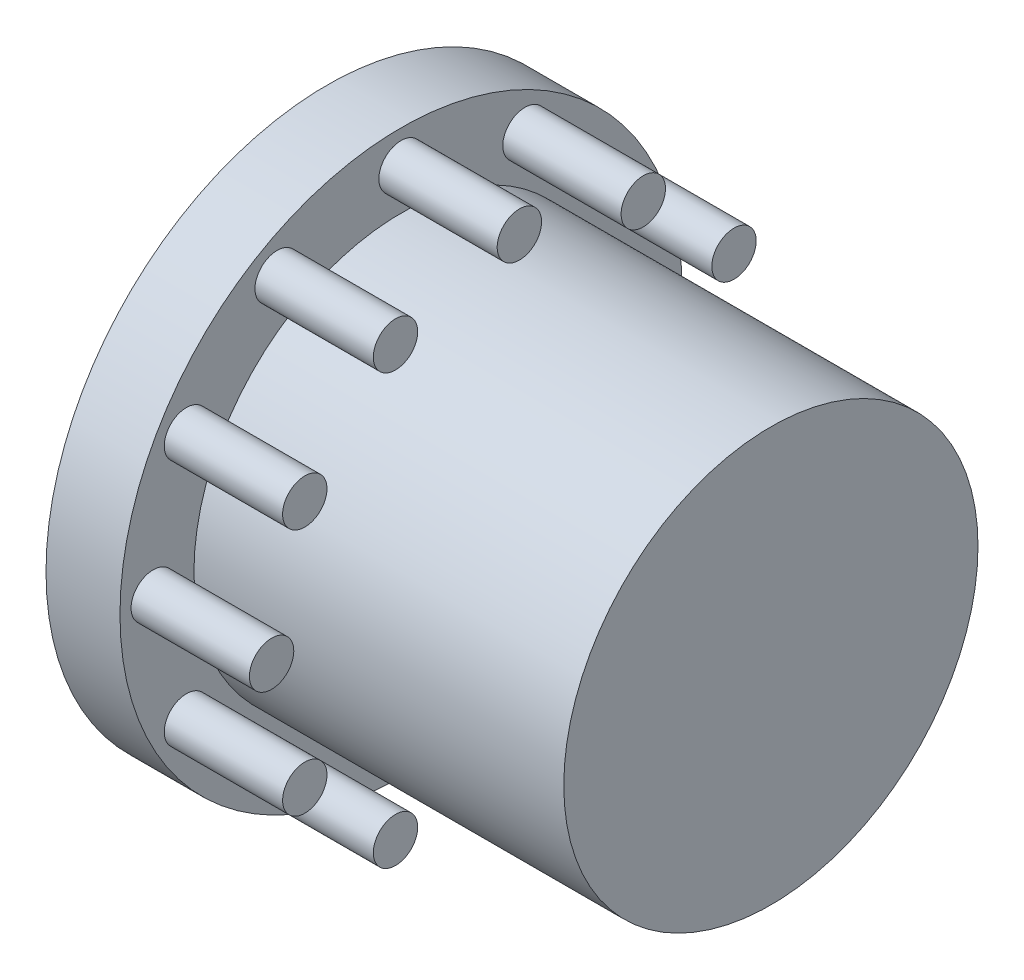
ISO-10303-21;
HEADER;
FILE_DESCRIPTION(('STEP AP214'),'2;1');
FILE_NAME('part.step','',(''),(''),'','','');
FILE_SCHEMA(('AUTOMOTIVE_DESIGN { 1 0 10303 214 1 1 1 1 }'));
ENDSEC;
DATA;
#1=APPLICATION_CONTEXT('core data for automotive mechanical design processes');
#2=APPLICATION_PROTOCOL_DEFINITION('international standard','automotive_design',2000,#1);
#3=PRODUCT_CONTEXT('',#1,'mechanical');
#4=PRODUCT('Part','Part','',(#3));
#5=PRODUCT_RELATED_PRODUCT_CATEGORY('part','',(#4));
#6=PRODUCT_DEFINITION_FORMATION('','',#4);
#7=PRODUCT_DEFINITION_CONTEXT('part definition',#1,'design');
#8=PRODUCT_DEFINITION('design','',#6,#7);
#9=PRODUCT_DEFINITION_SHAPE('','',#8);
#10=(LENGTH_UNIT() NAMED_UNIT(*) SI_UNIT(.MILLI.,.METRE.));
#11=(NAMED_UNIT(*) PLANE_ANGLE_UNIT() SI_UNIT($,.RADIAN.));
#12=(NAMED_UNIT(*) SI_UNIT($,.STERADIAN.) SOLID_ANGLE_UNIT());
#13=UNCERTAINTY_MEASURE_WITH_UNIT(LENGTH_MEASURE(1.E-05),#10,'distance_accuracy_value','');
#14=(GEOMETRIC_REPRESENTATION_CONTEXT(3) GLOBAL_UNCERTAINTY_ASSIGNED_CONTEXT((#13)) GLOBAL_UNIT_ASSIGNED_CONTEXT((#10,
#11,#12)) REPRESENTATION_CONTEXT('',''));
#15=CARTESIAN_POINT('',(0.,0.,0.));
#16=DIRECTION('',(0.,0.,1.));
#17=DIRECTION('',(1.,0.,0.));
#18=AXIS2_PLACEMENT_3D('',#15,#16,#17);
#19=CARTESIAN_POINT('',(130.,167.5,0.));
#20=DIRECTION('',(-1.,0.,0.));
#21=DIRECTION('',(0.,0.,1.));
#22=AXIS2_PLACEMENT_3D('',#19,#20,#21);
#23=CYLINDRICAL_SURFACE('',#22,15.);
#24=CARTESIAN_POINT('',(130.,167.5,0.));
#25=DIRECTION('',(1.,0.,0.));
#26=DIRECTION('',(0.,0.,-1.));
#27=AXIS2_PLACEMENT_3D('',#24,#25,#26);
#28=CIRCLE('',#27,15.);
#29=CARTESIAN_POINT('',(130.,167.5,-15.));
#30=VERTEX_POINT('',#29);
#31=EDGE_CURVE('E11',#30,#30,#28,.T.);
#32=ORIENTED_EDGE('',*,*,#31,.F.);
#33=EDGE_LOOP('',(#32));
#34=FACE_BOUND('',#33,.T.);
#35=CARTESIAN_POINT('',(50.,167.5,0.));
#36=DIRECTION('',(1.,0.,0.));
#37=DIRECTION('',(0.,0.,-1.));
#38=AXIS2_PLACEMENT_3D('',#35,#36,#37);
#39=CIRCLE('',#38,15.);
#40=CARTESIAN_POINT('',(50.,167.5,-15.));
#41=VERTEX_POINT('',#40);
#42=EDGE_CURVE('E47',#41,#41,#39,.T.);
#43=ORIENTED_EDGE('',*,*,#42,.T.);
#44=EDGE_LOOP('',(#43));
#45=FACE_BOUND('',#44,.T.);
#46=ADVANCED_FACE('F44',(#34,#45),#23,.T.);
#47=CARTESIAN_POINT('',(130.,167.5,0.));
#48=DIRECTION('',(1.,0.,0.));
#49=DIRECTION('',(0.,0.,-1.));
#50=AXIS2_PLACEMENT_3D('',#47,#48,#49);
#51=PLANE('',#50);
#52=ORIENTED_EDGE('',*,*,#31,.T.);
#53=EDGE_LOOP('',(#52));
#54=FACE_BOUND('',#53,.T.);
#55=ADVANCED_FACE('F59',(#54),#51,.T.);
#56=CARTESIAN_POINT('',(50.,167.5,0.));
#57=DIRECTION('',(1.,0.,0.));
#58=DIRECTION('',(0.,0.,-1.));
#59=AXIS2_PLACEMENT_3D('',#56,#57,#58);
#60=PLANE('',#59);
#61=ORIENTED_EDGE('',*,*,#42,.F.);
#62=EDGE_LOOP('',(#61));
#63=FACE_BOUND('',#62,.T.);
#64=ADVANCED_FACE('F57',(#63),#60,.F.);
#65=CLOSED_SHELL('',(#46,#55,#64));
#66=MANIFOLD_SOLID_BREP('B2',#65);
#67=CARTESIAN_POINT('',(50.,0.,0.));
#68=DIRECTION('',(-1.,0.,0.));
#69=DIRECTION('',(0.,0.,1.));
#70=AXIS2_PLACEMENT_3D('',#67,#68,#69);
#71=CYLINDRICAL_SURFACE('',#70,190.);
#72=CARTESIAN_POINT('',(50.,0.,0.));
#73=DIRECTION('',(1.,0.,0.));
#74=DIRECTION('',(0.,0.,-1.));
#75=AXIS2_PLACEMENT_3D('',#72,#73,#74);
#76=CIRCLE('',#75,190.);
#77=CARTESIAN_POINT('',(50.,0.,-190.));
#78=VERTEX_POINT('',#77);
#79=EDGE_CURVE('E43',#78,#78,#76,.T.);
#80=ORIENTED_EDGE('',*,*,#79,.F.);
#81=EDGE_LOOP('',(#80));
#82=FACE_BOUND('',#81,.T.);
#83=CARTESIAN_POINT('',(0.,0.,0.));
#84=DIRECTION('',(1.,0.,0.));
#85=DIRECTION('',(0.,0.,-1.));
#86=AXIS2_PLACEMENT_3D('',#83,#84,#85);
#87=CIRCLE('',#86,190.);
#88=CARTESIAN_POINT('',(0.,0.,-190.));
#89=VERTEX_POINT('',#88);
#90=EDGE_CURVE('E93',#89,#89,#87,.T.);
#91=ORIENTED_EDGE('',*,*,#90,.T.);
#92=EDGE_LOOP('',(#91));
#93=FACE_BOUND('',#92,.T.);
#94=ADVANCED_FACE('F90',(#82,#93),#71,.T.);
#95=CARTESIAN_POINT('',(50.,0.,0.));
#96=DIRECTION('',(1.,0.,0.));
#97=DIRECTION('',(0.,0.,-1.));
#98=AXIS2_PLACEMENT_3D('',#95,#96,#97);
#99=PLANE('',#98);
#100=CARTESIAN_POINT('',(50.,145.059255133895,-83.7499999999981));
#101=DIRECTION('',(1.,0.,0.));
#102=DIRECTION('',(0.,-0.499999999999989,-0.866025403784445));
#103=AXIS2_PLACEMENT_3D('',#100,#101,#102);
#104=CIRCLE('',#103,15.);
#105=CARTESIAN_POINT('',(50.,137.559255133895,-96.7403810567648));
#106=VERTEX_POINT('',#105);
#107=EDGE_CURVE('E173',#106,#106,#104,.T.);
#108=ORIENTED_EDGE('',*,*,#107,.F.);
#109=EDGE_LOOP('',(#108));
#110=FACE_BOUND('',#109,.T.);
#111=CARTESIAN_POINT('',(50.,83.7500000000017,-145.059255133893));
#112=DIRECTION('',(1.,0.,0.));
#113=DIRECTION('',(0.,-0.866025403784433,-0.50000000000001));
#114=AXIS2_PLACEMENT_3D('',#111,#112,#113);
#115=CIRCLE('',#114,15.);
#116=CARTESIAN_POINT('',(50.,70.7596189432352,-152.559255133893));
#117=VERTEX_POINT('',#116);
#118=EDGE_CURVE('E167',#117,#117,#115,.T.);
#119=ORIENTED_EDGE('',*,*,#118,.F.);
#120=EDGE_LOOP('',(#119));
#121=FACE_BOUND('',#120,.T.);
#122=CARTESIAN_POINT('',(50.,1.75446937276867E-12,-167.5));
#123=DIRECTION('',(1.,0.,0.));
#124=DIRECTION('',(0.,-1.,0.));
#125=AXIS2_PLACEMENT_3D('',#122,#123,#124);
#126=CIRCLE('',#125,15.);
#127=CARTESIAN_POINT('',(50.,-14.9999999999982,-167.5));
#128=VERTEX_POINT('',#127);
#129=EDGE_CURVE('E161',#128,#128,#126,.T.);
#130=ORIENTED_EDGE('',*,*,#129,.F.);
#131=EDGE_LOOP('',(#130));
#132=FACE_BOUND('',#131,.T.);
#133=CARTESIAN_POINT('',(50.,-83.7499999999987,-145.059255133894));
#134=DIRECTION('',(1.,0.,0.));
#135=DIRECTION('',(0.,-0.866025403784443,0.499999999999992));
#136=AXIS2_PLACEMENT_3D('',#133,#134,#135);
#137=CIRCLE('',#136,15.);
#138=CARTESIAN_POINT('',(50.,-96.7403810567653,-137.559255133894));
#139=VERTEX_POINT('',#138);
#140=EDGE_CURVE('E155',#139,#139,#137,.T.);
#141=ORIENTED_EDGE('',*,*,#140,.F.);
#142=EDGE_LOOP('',(#141));
#143=FACE_BOUND('',#142,.T.);
#144=CARTESIAN_POINT('',(50.,-145.059255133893,-83.7500000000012));
#145=DIRECTION('',(1.,0.,0.));
#146=DIRECTION('',(0.,-0.500000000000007,0.866025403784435));
#147=AXIS2_PLACEMENT_3D('',#144,#145,#146);
#148=CIRCLE('',#147,15.);
#149=CARTESIAN_POINT('',(50.,-152.559255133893,-70.7596189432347));
#150=VERTEX_POINT('',#149);
#151=EDGE_CURVE('E149',#150,#150,#148,.T.);
#152=ORIENTED_EDGE('',*,*,#151,.F.);
#153=EDGE_LOOP('',(#152));
#154=FACE_BOUND('',#153,.T.);
#155=CARTESIAN_POINT('',(50.,-167.5,0.));
#156=DIRECTION('',(1.,0.,0.));
#157=DIRECTION('',(0.,0.,1.));
#158=AXIS2_PLACEMENT_3D('',#155,#156,#157);
#159=CIRCLE('',#158,15.);
#160=CARTESIAN_POINT('',(50.,-167.5,15.));
#161=VERTEX_POINT('',#160);
#162=EDGE_CURVE('E143',#161,#161,#159,.T.);
#163=ORIENTED_EDGE('',*,*,#162,.F.);
#164=EDGE_LOOP('',(#163));
#165=FACE_BOUND('',#164,.T.);
#166=CARTESIAN_POINT('',(50.,-145.059255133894,83.7499999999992));
#167=DIRECTION('',(1.,0.,0.));
#168=DIRECTION('',(0.,0.499999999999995,0.866025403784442));
#169=AXIS2_PLACEMENT_3D('',#166,#167,#168);
#170=CIRCLE('',#169,15.);
#171=CARTESIAN_POINT('',(50.,-137.559255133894,96.7403810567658));
#172=VERTEX_POINT('',#171);
#173=EDGE_CURVE('E137',#172,#172,#170,.T.);
#174=ORIENTED_EDGE('',*,*,#173,.F.);
#175=EDGE_LOOP('',(#174));
#176=FACE_BOUND('',#175,.T.);
#177=CARTESIAN_POINT('',(50.,-83.7500000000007,145.059255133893));
#178=DIRECTION('',(1.,0.,0.));
#179=DIRECTION('',(0.,0.866025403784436,0.500000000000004));
#180=AXIS2_PLACEMENT_3D('',#177,#178,#179);
#181=CIRCLE('',#180,15.);
#182=CARTESIAN_POINT('',(50.,-70.7596189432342,152.559255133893));
#183=VERTEX_POINT('',#182);
#184=EDGE_CURVE('E131',#183,#183,#181,.T.);
#185=ORIENTED_EDGE('',*,*,#184,.F.);
#186=EDGE_LOOP('',(#185));
#187=FACE_BOUND('',#186,.T.);
#188=CARTESIAN_POINT('',(50.,-5.84823124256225E-13,167.5));
#189=DIRECTION('',(1.,0.,0.));
#190=DIRECTION('',(0.,1.,0.));
#191=AXIS2_PLACEMENT_3D('',#188,#189,#190);
#192=CIRCLE('',#191,15.);
#193=CARTESIAN_POINT('',(50.,14.9999999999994,167.5));
#194=VERTEX_POINT('',#193);
#195=EDGE_CURVE('E125',#194,#194,#192,.T.);
#196=ORIENTED_EDGE('',*,*,#195,.F.);
#197=EDGE_LOOP('',(#196));
#198=FACE_BOUND('',#197,.T.);
#199=CARTESIAN_POINT('',(50.,83.7499999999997,145.059255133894));
#200=DIRECTION('',(1.,0.,0.));
#201=DIRECTION('',(0.,0.86602540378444,-0.499999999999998));
#202=AXIS2_PLACEMENT_3D('',#199,#200,#201);
#203=CIRCLE('',#202,15.);
#204=CARTESIAN_POINT('',(50.,96.7403810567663,137.559255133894));
#205=VERTEX_POINT('',#204);
#206=EDGE_CURVE('E119',#205,#205,#203,.T.);
#207=ORIENTED_EDGE('',*,*,#206,.F.);
#208=EDGE_LOOP('',(#207));
#209=FACE_BOUND('',#208,.T.);
#210=CARTESIAN_POINT('',(50.,145.059255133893,83.7500000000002));
#211=DIRECTION('',(1.,0.,0.));
#212=DIRECTION('',(0.,0.500000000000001,-0.866025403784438));
#213=AXIS2_PLACEMENT_3D('',#210,#211,#212);
#214=CIRCLE('',#213,15.);
#215=CARTESIAN_POINT('',(50.,152.559255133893,70.7596189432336));
#216=VERTEX_POINT('',#215);
#217=EDGE_CURVE('E113',#216,#216,#214,.T.);
#218=ORIENTED_EDGE('',*,*,#217,.F.);
#219=EDGE_LOOP('',(#218));
#220=FACE_BOUND('',#219,.T.);
#221=CARTESIAN_POINT('',(50.,0.,0.));
#222=DIRECTION('',(1.,0.,0.));
#223=DIRECTION('',(0.,0.,-1.));
#224=AXIS2_PLACEMENT_3D('',#221,#222,#223);
#225=CIRCLE('',#224,140.);
#226=CARTESIAN_POINT('',(50.,0.,-140.));
#227=VERTEX_POINT('',#226);
#228=EDGE_CURVE('E105',#227,#227,#225,.F.);
#229=ORIENTED_EDGE('',*,*,#228,.T.);
#230=EDGE_LOOP('',(#229));
#231=FACE_BOUND('',#230,.T.);
#232=ORIENTED_EDGE('',*,*,#79,.T.);
#233=EDGE_LOOP('',(#232));
#234=FACE_BOUND('',#233,.T.);
#235=ADVANCED_FACE('F189',(#110,#121,#132,#143,#154,#165,#176,#187,#198,#209,#220,#231,#234),
#99,.T.);
#236=CARTESIAN_POINT('',(0.,0.,0.));
#237=DIRECTION('',(1.,0.,0.));
#238=DIRECTION('',(0.,0.,-1.));
#239=AXIS2_PLACEMENT_3D('',#236,#237,#238);
#240=PLANE('',#239);
#241=ORIENTED_EDGE('',*,*,#90,.F.);
#242=EDGE_LOOP('',(#241));
#243=FACE_BOUND('',#242,.T.);
#244=CARTESIAN_POINT('',(0.,0.,0.));
#245=DIRECTION('',(1.,0.,0.));
#246=DIRECTION('',(0.,0.,-1.));
#247=AXIS2_PLACEMENT_3D('',#244,#245,#246);
#248=CIRCLE('',#247,50.);
#249=CARTESIAN_POINT('',(0.,0.,-50.));
#250=VERTEX_POINT('',#249);
#251=EDGE_CURVE('E102',#250,#250,#248,.T.);
#252=ORIENTED_EDGE('',*,*,#251,.T.);
#253=EDGE_LOOP('',(#252));
#254=FACE_BOUND('',#253,.T.);
#255=ADVANCED_FACE('F192',(#243,#254),#240,.F.);
#256=CARTESIAN_POINT('',(-50.,0.,0.));
#257=DIRECTION('',(1.,0.,0.));
#258=DIRECTION('',(0.,0.,-1.));
#259=AXIS2_PLACEMENT_3D('',#256,#257,#258);
#260=CYLINDRICAL_SURFACE('',#259,50.);
#261=CARTESIAN_POINT('',(-50.,0.,0.));
#262=DIRECTION('',(1.,0.,0.));
#263=DIRECTION('',(0.,0.,-1.));
#264=AXIS2_PLACEMENT_3D('',#261,#262,#263);
#265=CIRCLE('',#264,50.);
#266=CARTESIAN_POINT('',(-50.,0.,-50.));
#267=VERTEX_POINT('',#266);
#268=EDGE_CURVE('E100',#267,#267,#265,.T.);
#269=ORIENTED_EDGE('',*,*,#268,.T.);
#270=EDGE_LOOP('',(#269));
#271=FACE_BOUND('',#270,.T.);
#272=ORIENTED_EDGE('',*,*,#251,.F.);
#273=EDGE_LOOP('',(#272));
#274=FACE_BOUND('',#273,.T.);
#275=ADVANCED_FACE('F247',(#271,#274),#260,.T.);
#276=CARTESIAN_POINT('',(-50.,0.,0.));
#277=DIRECTION('',(1.,0.,0.));
#278=DIRECTION('',(0.,0.,-1.));
#279=AXIS2_PLACEMENT_3D('',#276,#277,#278);
#280=PLANE('',#279);
#281=ORIENTED_EDGE('',*,*,#268,.F.);
#282=EDGE_LOOP('',(#281));
#283=FACE_BOUND('',#282,.T.);
#284=ADVANCED_FACE('F220',(#283),#280,.F.);
#285=CARTESIAN_POINT('',(300.,0.,0.));
#286=DIRECTION('',(-1.,0.,0.));
#287=DIRECTION('',(0.,0.,1.));
#288=AXIS2_PLACEMENT_3D('',#285,#286,#287);
#289=CYLINDRICAL_SURFACE('',#288,140.);
#290=ORIENTED_EDGE('',*,*,#228,.F.);
#291=EDGE_LOOP('',(#290));
#292=FACE_BOUND('',#291,.T.);
#293=CARTESIAN_POINT('',(300.,0.,0.));
#294=DIRECTION('',(1.,0.,0.));
#295=DIRECTION('',(0.,0.,-1.));
#296=AXIS2_PLACEMENT_3D('',#293,#294,#295);
#297=CIRCLE('',#296,140.);
#298=CARTESIAN_POINT('',(300.,0.,-140.));
#299=VERTEX_POINT('',#298);
#300=EDGE_CURVE('E110',#299,#299,#297,.T.);
#301=ORIENTED_EDGE('',*,*,#300,.F.);
#302=EDGE_LOOP('',(#301));
#303=FACE_BOUND('',#302,.T.);
#304=ADVANCED_FACE('F216',(#292,#303),#289,.T.);
#305=CARTESIAN_POINT('',(300.,0.,0.));
#306=DIRECTION('',(1.,0.,0.));
#307=DIRECTION('',(0.,0.,-1.));
#308=AXIS2_PLACEMENT_3D('',#305,#306,#307);
#309=PLANE('',#308);
#310=ORIENTED_EDGE('',*,*,#300,.T.);
#311=EDGE_LOOP('',(#310));
#312=FACE_BOUND('',#311,.T.);
#313=ADVANCED_FACE('F219',(#312),#309,.T.);
#314=CARTESIAN_POINT('',(130.,145.059255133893,83.7500000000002));
#315=DIRECTION('',(-1.,0.,0.));
#316=DIRECTION('',(0.,-0.500000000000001,0.866025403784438));
#317=AXIS2_PLACEMENT_3D('',#314,#315,#316);
#318=CYLINDRICAL_SURFACE('',#317,15.);
#319=CARTESIAN_POINT('',(130.,145.059255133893,83.7500000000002));
#320=DIRECTION('',(1.,0.,0.));
#321=DIRECTION('',(0.,0.500000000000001,-0.866025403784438));
#322=AXIS2_PLACEMENT_3D('',#319,#320,#321);
#323=CIRCLE('',#322,15.);
#324=CARTESIAN_POINT('',(130.,152.559255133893,70.7596189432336));
#325=VERTEX_POINT('',#324);
#326=EDGE_CURVE('E116',#325,#325,#323,.T.);
#327=ORIENTED_EDGE('',*,*,#326,.F.);
#328=EDGE_LOOP('',(#327));
#329=FACE_BOUND('',#328,.T.);
#330=ORIENTED_EDGE('',*,*,#217,.T.);
#331=EDGE_LOOP('',(#330));
#332=FACE_BOUND('',#331,.T.);
#333=ADVANCED_FACE('F225',(#329,#332),#318,.T.);
#334=CARTESIAN_POINT('',(130.,145.059255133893,83.7500000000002));
#335=DIRECTION('',(1.,0.,0.));
#336=DIRECTION('',(0.,0.500000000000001,-0.866025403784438));
#337=AXIS2_PLACEMENT_3D('',#334,#335,#336);
#338=PLANE('',#337);
#339=ORIENTED_EDGE('',*,*,#326,.T.);
#340=EDGE_LOOP('',(#339));
#341=FACE_BOUND('',#340,.T.);
#342=ADVANCED_FACE('F227',(#341),#338,.T.);
#343=CARTESIAN_POINT('',(130.,83.7499999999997,145.059255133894));
#344=DIRECTION('',(-1.,0.,0.));
#345=DIRECTION('',(0.,-0.86602540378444,0.499999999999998));
#346=AXIS2_PLACEMENT_3D('',#343,#344,#345);
#347=CYLINDRICAL_SURFACE('',#346,15.);
#348=CARTESIAN_POINT('',(130.,83.7499999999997,145.059255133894));
#349=DIRECTION('',(1.,0.,0.));
#350=DIRECTION('',(0.,0.86602540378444,-0.499999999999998));
#351=AXIS2_PLACEMENT_3D('',#348,#349,#350);
#352=CIRCLE('',#351,15.);
#353=CARTESIAN_POINT('',(130.,96.7403810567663,137.559255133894));
#354=VERTEX_POINT('',#353);
#355=EDGE_CURVE('E122',#354,#354,#352,.T.);
#356=ORIENTED_EDGE('',*,*,#355,.F.);
#357=EDGE_LOOP('',(#356));
#358=FACE_BOUND('',#357,.T.);
#359=ORIENTED_EDGE('',*,*,#206,.T.);
#360=EDGE_LOOP('',(#359));
#361=FACE_BOUND('',#360,.T.);
#362=ADVANCED_FACE('F236',(#358,#361),#347,.T.);
#363=CARTESIAN_POINT('',(130.,83.7499999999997,145.059255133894));
#364=DIRECTION('',(1.,0.,0.));
#365=DIRECTION('',(0.,0.86602540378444,-0.499999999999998));
#366=AXIS2_PLACEMENT_3D('',#363,#364,#365);
#367=PLANE('',#366);
#368=ORIENTED_EDGE('',*,*,#355,.T.);
#369=EDGE_LOOP('',(#368));
#370=FACE_BOUND('',#369,.T.);
#371=ADVANCED_FACE('F233',(#370),#367,.T.);
#372=CARTESIAN_POINT('',(130.,-5.84823124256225E-13,167.5));
#373=DIRECTION('',(-1.,0.,0.));
#374=DIRECTION('',(0.,-1.,0.));
#375=AXIS2_PLACEMENT_3D('',#372,#373,#374);
#376=CYLINDRICAL_SURFACE('',#375,15.);
#377=CARTESIAN_POINT('',(130.,-5.84823124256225E-13,167.5));
#378=DIRECTION('',(1.,0.,0.));
#379=DIRECTION('',(0.,1.,0.));
#380=AXIS2_PLACEMENT_3D('',#377,#378,#379);
#381=CIRCLE('',#380,15.);
#382=CARTESIAN_POINT('',(130.,14.9999999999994,167.5));
#383=VERTEX_POINT('',#382);
#384=EDGE_CURVE('E128',#383,#383,#381,.T.);
#385=ORIENTED_EDGE('',*,*,#384,.F.);
#386=EDGE_LOOP('',(#385));
#387=FACE_BOUND('',#386,.T.);
#388=ORIENTED_EDGE('',*,*,#195,.T.);
#389=EDGE_LOOP('',(#388));
#390=FACE_BOUND('',#389,.T.);
#391=ADVANCED_FACE('F316',(#387,#390),#376,.T.);
#392=CARTESIAN_POINT('',(130.,-5.84823124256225E-13,167.5));
#393=DIRECTION('',(1.,0.,0.));
#394=DIRECTION('',(0.,1.,0.));
#395=AXIS2_PLACEMENT_3D('',#392,#393,#394);
#396=PLANE('',#395);
#397=ORIENTED_EDGE('',*,*,#384,.T.);
#398=EDGE_LOOP('',(#397));
#399=FACE_BOUND('',#398,.T.);
#400=ADVANCED_FACE('F307',(#399),#396,.T.);
#401=CARTESIAN_POINT('',(130.,-83.7500000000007,145.059255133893));
#402=DIRECTION('',(-1.,0.,0.));
#403=DIRECTION('',(0.,-0.866025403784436,-0.500000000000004));
#404=AXIS2_PLACEMENT_3D('',#401,#402,#403);
#405=CYLINDRICAL_SURFACE('',#404,15.);
#406=CARTESIAN_POINT('',(130.,-83.7500000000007,145.059255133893));
#407=DIRECTION('',(1.,0.,0.));
#408=DIRECTION('',(0.,0.866025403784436,0.500000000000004));
#409=AXIS2_PLACEMENT_3D('',#406,#407,#408);
#410=CIRCLE('',#409,15.);
#411=CARTESIAN_POINT('',(130.,-70.7596189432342,152.559255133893));
#412=VERTEX_POINT('',#411);
#413=EDGE_CURVE('E134',#412,#412,#410,.T.);
#414=ORIENTED_EDGE('',*,*,#413,.F.);
#415=EDGE_LOOP('',(#414));
#416=FACE_BOUND('',#415,.T.);
#417=ORIENTED_EDGE('',*,*,#184,.T.);
#418=EDGE_LOOP('',(#417));
#419=FACE_BOUND('',#418,.T.);
#420=ADVANCED_FACE('F338',(#416,#419),#405,.T.);
#421=CARTESIAN_POINT('',(130.,-83.7500000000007,145.059255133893));
#422=DIRECTION('',(1.,0.,0.));
#423=DIRECTION('',(0.,0.866025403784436,0.500000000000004));
#424=AXIS2_PLACEMENT_3D('',#421,#422,#423);
#425=PLANE('',#424);
#426=ORIENTED_EDGE('',*,*,#413,.T.);
#427=EDGE_LOOP('',(#426));
#428=FACE_BOUND('',#427,.T.);
#429=ADVANCED_FACE('F329',(#428),#425,.T.);
#430=CARTESIAN_POINT('',(130.,-145.059255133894,83.7499999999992));
#431=DIRECTION('',(-1.,0.,0.));
#432=DIRECTION('',(0.,-0.499999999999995,-0.866025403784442));
#433=AXIS2_PLACEMENT_3D('',#430,#431,#432);
#434=CYLINDRICAL_SURFACE('',#433,15.);
#435=CARTESIAN_POINT('',(130.,-145.059255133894,83.7499999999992));
#436=DIRECTION('',(1.,0.,0.));
#437=DIRECTION('',(0.,0.499999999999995,0.866025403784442));
#438=AXIS2_PLACEMENT_3D('',#435,#436,#437);
#439=CIRCLE('',#438,15.);
#440=CARTESIAN_POINT('',(130.,-137.559255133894,96.7403810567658));
#441=VERTEX_POINT('',#440);
#442=EDGE_CURVE('E140',#441,#441,#439,.T.);
#443=ORIENTED_EDGE('',*,*,#442,.F.);
#444=EDGE_LOOP('',(#443));
#445=FACE_BOUND('',#444,.T.);
#446=ORIENTED_EDGE('',*,*,#173,.T.);
#447=EDGE_LOOP('',(#446));
#448=FACE_BOUND('',#447,.T.);
#449=ADVANCED_FACE('F360',(#445,#448),#434,.T.);
#450=CARTESIAN_POINT('',(130.,-145.059255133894,83.7499999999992));
#451=DIRECTION('',(1.,0.,0.));
#452=DIRECTION('',(0.,0.499999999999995,0.866025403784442));
#453=AXIS2_PLACEMENT_3D('',#450,#451,#452);
#454=PLANE('',#453);
#455=ORIENTED_EDGE('',*,*,#442,.T.);
#456=EDGE_LOOP('',(#455));
#457=FACE_BOUND('',#456,.T.);
#458=ADVANCED_FACE('F351',(#457),#454,.T.);
#459=CARTESIAN_POINT('',(130.,-167.5,0.));
#460=DIRECTION('',(-1.,0.,0.));
#461=DIRECTION('',(0.,0.,-1.));
#462=AXIS2_PLACEMENT_3D('',#459,#460,#461);
#463=CYLINDRICAL_SURFACE('',#462,15.);
#464=CARTESIAN_POINT('',(130.,-167.5,0.));
#465=DIRECTION('',(1.,0.,0.));
#466=DIRECTION('',(0.,0.,1.));
#467=AXIS2_PLACEMENT_3D('',#464,#465,#466);
#468=CIRCLE('',#467,15.);
#469=CARTESIAN_POINT('',(130.,-167.5,15.));
#470=VERTEX_POINT('',#469);
#471=EDGE_CURVE('E146',#470,#470,#468,.T.);
#472=ORIENTED_EDGE('',*,*,#471,.F.);
#473=EDGE_LOOP('',(#472));
#474=FACE_BOUND('',#473,.T.);
#475=ORIENTED_EDGE('',*,*,#162,.T.);
#476=EDGE_LOOP('',(#475));
#477=FACE_BOUND('',#476,.T.);
#478=ADVANCED_FACE('F382',(#474,#477),#463,.T.);
#479=CARTESIAN_POINT('',(130.,-167.5,0.));
#480=DIRECTION('',(1.,0.,0.));
#481=DIRECTION('',(0.,0.,1.));
#482=AXIS2_PLACEMENT_3D('',#479,#480,#481);
#483=PLANE('',#482);
#484=ORIENTED_EDGE('',*,*,#471,.T.);
#485=EDGE_LOOP('',(#484));
#486=FACE_BOUND('',#485,.T.);
#487=ADVANCED_FACE('F373',(#486),#483,.T.);
#488=CARTESIAN_POINT('',(130.,-145.059255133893,-83.7500000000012));
#489=DIRECTION('',(-1.,0.,0.));
#490=DIRECTION('',(0.,0.500000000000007,-0.866025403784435));
#491=AXIS2_PLACEMENT_3D('',#488,#489,#490);
#492=CYLINDRICAL_SURFACE('',#491,15.);
#493=CARTESIAN_POINT('',(130.,-145.059255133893,-83.7500000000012));
#494=DIRECTION('',(1.,0.,0.));
#495=DIRECTION('',(0.,-0.500000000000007,0.866025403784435));
#496=AXIS2_PLACEMENT_3D('',#493,#494,#495);
#497=CIRCLE('',#496,15.);
#498=CARTESIAN_POINT('',(130.,-152.559255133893,-70.7596189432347));
#499=VERTEX_POINT('',#498);
#500=EDGE_CURVE('E152',#499,#499,#497,.T.);
#501=ORIENTED_EDGE('',*,*,#500,.F.);
#502=EDGE_LOOP('',(#501));
#503=FACE_BOUND('',#502,.T.);
#504=ORIENTED_EDGE('',*,*,#151,.T.);
#505=EDGE_LOOP('',(#504));
#506=FACE_BOUND('',#505,.T.);
#507=ADVANCED_FACE('F404',(#503,#506),#492,.T.);
#508=CARTESIAN_POINT('',(130.,-145.059255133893,-83.7500000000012));
#509=DIRECTION('',(1.,0.,0.));
#510=DIRECTION('',(0.,-0.500000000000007,0.866025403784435));
#511=AXIS2_PLACEMENT_3D('',#508,#509,#510);
#512=PLANE('',#511);
#513=ORIENTED_EDGE('',*,*,#500,.T.);
#514=EDGE_LOOP('',(#513));
#515=FACE_BOUND('',#514,.T.);
#516=ADVANCED_FACE('F395',(#515),#512,.T.);
#517=CARTESIAN_POINT('',(130.,-83.7499999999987,-145.059255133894));
#518=DIRECTION('',(-1.,0.,0.));
#519=DIRECTION('',(0.,0.866025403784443,-0.499999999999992));
#520=AXIS2_PLACEMENT_3D('',#517,#518,#519);
#521=CYLINDRICAL_SURFACE('',#520,15.);
#522=CARTESIAN_POINT('',(130.,-83.7499999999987,-145.059255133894));
#523=DIRECTION('',(1.,0.,0.));
#524=DIRECTION('',(0.,-0.866025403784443,0.499999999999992));
#525=AXIS2_PLACEMENT_3D('',#522,#523,#524);
#526=CIRCLE('',#525,15.);
#527=CARTESIAN_POINT('',(130.,-96.7403810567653,-137.559255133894));
#528=VERTEX_POINT('',#527);
#529=EDGE_CURVE('E158',#528,#528,#526,.T.);
#530=ORIENTED_EDGE('',*,*,#529,.F.);
#531=EDGE_LOOP('',(#530));
#532=FACE_BOUND('',#531,.T.);
#533=ORIENTED_EDGE('',*,*,#140,.T.);
#534=EDGE_LOOP('',(#533));
#535=FACE_BOUND('',#534,.T.);
#536=ADVANCED_FACE('F426',(#532,#535),#521,.T.);
#537=CARTESIAN_POINT('',(130.,-83.7499999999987,-145.059255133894));
#538=DIRECTION('',(1.,0.,0.));
#539=DIRECTION('',(0.,-0.866025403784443,0.499999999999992));
#540=AXIS2_PLACEMENT_3D('',#537,#538,#539);
#541=PLANE('',#540);
#542=ORIENTED_EDGE('',*,*,#529,.T.);
#543=EDGE_LOOP('',(#542));
#544=FACE_BOUND('',#543,.T.);
#545=ADVANCED_FACE('F417',(#544),#541,.T.);
#546=CARTESIAN_POINT('',(130.,1.75446937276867E-12,-167.5));
#547=DIRECTION('',(-1.,0.,0.));
#548=DIRECTION('',(0.,1.,0.));
#549=AXIS2_PLACEMENT_3D('',#546,#547,#548);
#550=CYLINDRICAL_SURFACE('',#549,15.);
#551=CARTESIAN_POINT('',(130.,1.75446937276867E-12,-167.5));
#552=DIRECTION('',(1.,0.,0.));
#553=DIRECTION('',(0.,-1.,0.));
#554=AXIS2_PLACEMENT_3D('',#551,#552,#553);
#555=CIRCLE('',#554,15.);
#556=CARTESIAN_POINT('',(130.,-14.9999999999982,-167.5));
#557=VERTEX_POINT('',#556);
#558=EDGE_CURVE('E164',#557,#557,#555,.T.);
#559=ORIENTED_EDGE('',*,*,#558,.F.);
#560=EDGE_LOOP('',(#559));
#561=FACE_BOUND('',#560,.T.);
#562=ORIENTED_EDGE('',*,*,#129,.T.);
#563=EDGE_LOOP('',(#562));
#564=FACE_BOUND('',#563,.T.);
#565=ADVANCED_FACE('F448',(#561,#564),#550,.T.);
#566=CARTESIAN_POINT('',(130.,1.75446937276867E-12,-167.5));
#567=DIRECTION('',(1.,0.,0.));
#568=DIRECTION('',(0.,-1.,0.));
#569=AXIS2_PLACEMENT_3D('',#566,#567,#568);
#570=PLANE('',#569);
#571=ORIENTED_EDGE('',*,*,#558,.T.);
#572=EDGE_LOOP('',(#571));
#573=FACE_BOUND('',#572,.T.);
#574=ADVANCED_FACE('F439',(#573),#570,.T.);
#575=CARTESIAN_POINT('',(130.,83.7500000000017,-145.059255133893));
#576=DIRECTION('',(-1.,0.,0.));
#577=DIRECTION('',(0.,0.866025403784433,0.50000000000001));
#578=AXIS2_PLACEMENT_3D('',#575,#576,#577);
#579=CYLINDRICAL_SURFACE('',#578,15.);
#580=CARTESIAN_POINT('',(130.,83.7500000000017,-145.059255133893));
#581=DIRECTION('',(1.,0.,0.));
#582=DIRECTION('',(0.,-0.866025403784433,-0.50000000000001));
#583=AXIS2_PLACEMENT_3D('',#580,#581,#582);
#584=CIRCLE('',#583,15.);
#585=CARTESIAN_POINT('',(130.,70.7596189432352,-152.559255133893));
#586=VERTEX_POINT('',#585);
#587=EDGE_CURVE('E170',#586,#586,#584,.T.);
#588=ORIENTED_EDGE('',*,*,#587,.F.);
#589=EDGE_LOOP('',(#588));
#590=FACE_BOUND('',#589,.T.);
#591=ORIENTED_EDGE('',*,*,#118,.T.);
#592=EDGE_LOOP('',(#591));
#593=FACE_BOUND('',#592,.T.);
#594=ADVANCED_FACE('F469',(#590,#593),#579,.T.);
#595=CARTESIAN_POINT('',(130.,83.7500000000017,-145.059255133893));
#596=DIRECTION('',(1.,0.,0.));
#597=DIRECTION('',(0.,-0.866025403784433,-0.50000000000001));
#598=AXIS2_PLACEMENT_3D('',#595,#596,#597);
#599=PLANE('',#598);
#600=ORIENTED_EDGE('',*,*,#587,.T.);
#601=EDGE_LOOP('',(#600));
#602=FACE_BOUND('',#601,.T.);
#603=ADVANCED_FACE('F185',(#602),#599,.T.);
#604=CARTESIAN_POINT('',(130.,145.059255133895,-83.7499999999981));
#605=DIRECTION('',(-1.,0.,0.));
#606=DIRECTION('',(0.,0.499999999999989,0.866025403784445));
#607=AXIS2_PLACEMENT_3D('',#604,#605,#606);
#608=CYLINDRICAL_SURFACE('',#607,15.);
#609=CARTESIAN_POINT('',(130.,145.059255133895,-83.7499999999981));
#610=DIRECTION('',(1.,0.,0.));
#611=DIRECTION('',(0.,-0.499999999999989,-0.866025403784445));
#612=AXIS2_PLACEMENT_3D('',#609,#610,#611);
#613=CIRCLE('',#612,15.);
#614=CARTESIAN_POINT('',(130.,137.559255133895,-96.7403810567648));
#615=VERTEX_POINT('',#614);
#616=EDGE_CURVE('E176',#615,#615,#613,.T.);
#617=ORIENTED_EDGE('',*,*,#616,.F.);
#618=EDGE_LOOP('',(#617));
#619=FACE_BOUND('',#618,.T.);
#620=ORIENTED_EDGE('',*,*,#107,.T.);
#621=EDGE_LOOP('',(#620));
#622=FACE_BOUND('',#621,.T.);
#623=ADVANCED_FACE('F182',(#619,#622),#608,.T.);
#624=CARTESIAN_POINT('',(130.,145.059255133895,-83.7499999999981));
#625=DIRECTION('',(1.,0.,0.));
#626=DIRECTION('',(0.,-0.499999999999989,-0.866025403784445));
#627=AXIS2_PLACEMENT_3D('',#624,#625,#626);
#628=PLANE('',#627);
#629=ORIENTED_EDGE('',*,*,#616,.T.);
#630=EDGE_LOOP('',(#629));
#631=FACE_BOUND('',#630,.T.);
#632=ADVANCED_FACE('F180',(#631),#628,.T.);
#633=CLOSED_SHELL('',(#94,#235,#255,#275,#284,#304,#313,#333,#342,#362,#371,#391,#400,#420,#429,
#449,#458,#478,#487,#507,#516,#536,#545,#565,#574,#594,#603,#623,#632));
#634=MANIFOLD_SOLID_BREP('B6',#633);
#635=ADVANCED_BREP_SHAPE_REPRESENTATION('',(#18,#66,#634),#14);
#636=SHAPE_DEFINITION_REPRESENTATION(#9,#635);
ENDSEC;
END-ISO-10303-21;
